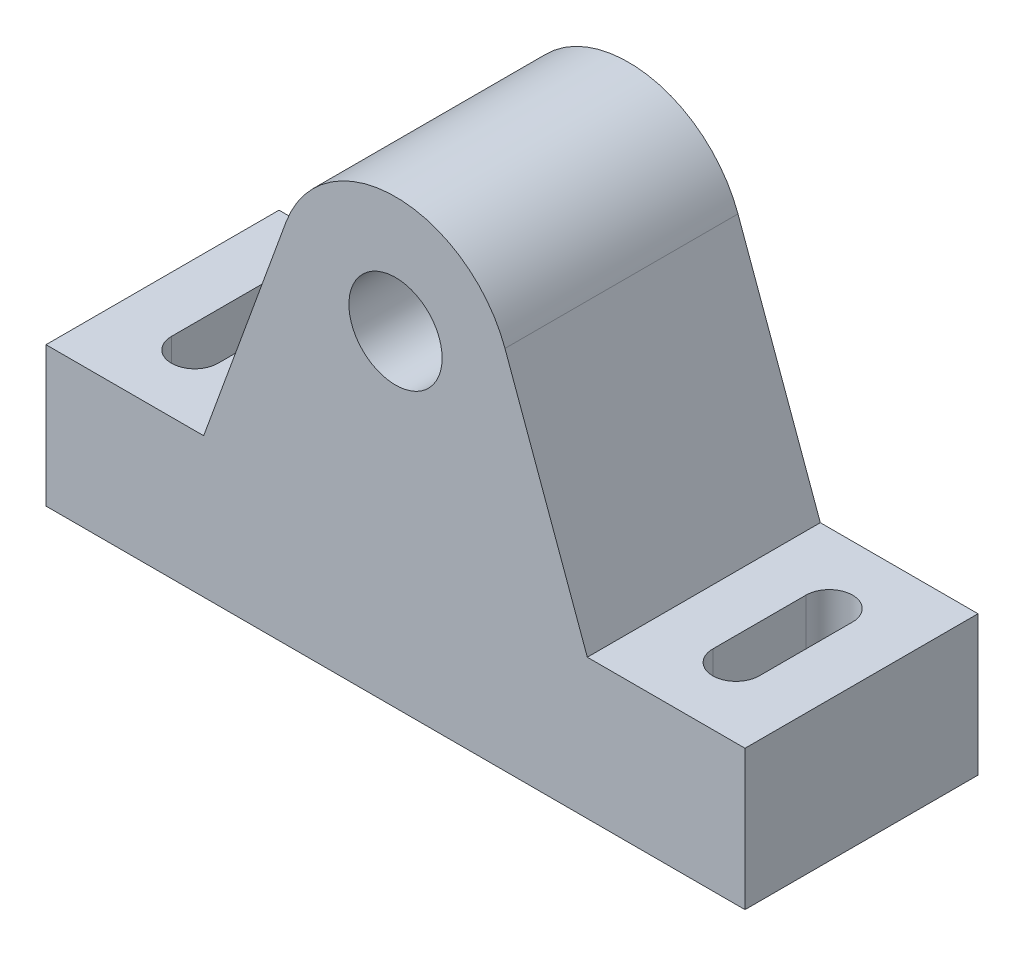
from build123d import *

# Parameters (mm, degrees)
ESQUISSE1_R             = 10
BOSS_EXTRU_1_DEPTH      = 25
ENL_V_MAT_EXTRU_1_DEPTH = 103.347447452


with BuildPart() as part:
    # Esquisse1 → Boss.-Extru.1 (new, symmetric)
    with BuildSketch(Plane.XY):
        with BuildLine():
            Line((75, 0), (-75, 0))
            Line((-75, 0), (-75, 30))
            Line((-75, 30), (-41.163253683, 30))
            Line((-41.163253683, 30), (-23.49231552, 78.550503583))
            ThreePointArc((-23.49231552, 78.550503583), (0, 95), (23.49231552, 78.550503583))
            Line((23.49231552, 78.550503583), (41.163253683, 30))
            Line((41.163253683, 30), (75, 30))
            Line((75, 30), (75, 0))
        make_face()
        with Locations((0, 70)):
            Circle(ESQUISSE1_R, mode=Mode.SUBTRACT)
    extrude(amount=BOSS_EXTRU_1_DEPTH, both=True)

    # Esquisse2 → Enl_v. mat.-Extru.1 (cut, through all)
    with BuildSketch(Plane(origin=(0, 30, 0), x_dir=(1, 0, 0), z_dir=(0, 1, 0))):
        with BuildLine():
            Line((-63.081626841, -10), (-63.081626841, 10))
            ThreePointArc((-63.081626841, 10), (-58.081626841, 15), (-53.081626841, 10))
            Line((-53.081626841, 10), (-53.081626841, -10))
            ThreePointArc((-53.081626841, -10), (-58.081626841, -15), (-63.081626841, -10))
        make_face()
        with BuildLine():
            Line((63.081626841, -10), (63.081626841, 10))
            ThreePointArc((63.081626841, 10), (58.081626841, 15), (53.081626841, 10))
            Line((53.081626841, 10), (53.081626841, -10))
            ThreePointArc((53.081626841, -10), (58.081626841, -15), (63.081626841, -10))
        make_face()
    extrude(amount=-ENL_V_MAT_EXTRU_1_DEPTH, mode=Mode.SUBTRACT)


solid = part.part
